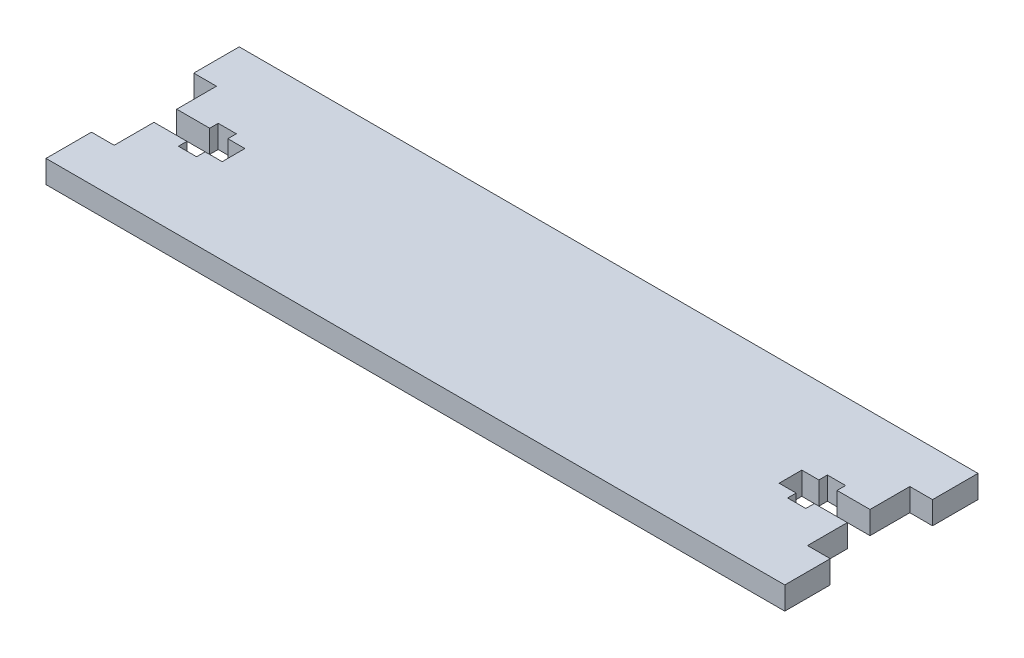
ISO-10303-21;
HEADER;
FILE_DESCRIPTION(('STEP AP214'),'2;1');
FILE_NAME('part.step','',(''),(''),'','','');
FILE_SCHEMA(('AUTOMOTIVE_DESIGN { 1 0 10303 214 1 1 1 1 }'));
ENDSEC;
DATA;
#1=APPLICATION_CONTEXT('core data for automotive mechanical design processes');
#2=APPLICATION_PROTOCOL_DEFINITION('international standard','automotive_design',2000,#1);
#3=PRODUCT_CONTEXT('',#1,'mechanical');
#4=PRODUCT('Part','Part','',(#3));
#5=PRODUCT_RELATED_PRODUCT_CATEGORY('part','',(#4));
#6=PRODUCT_DEFINITION_FORMATION('','',#4);
#7=PRODUCT_DEFINITION_CONTEXT('part definition',#1,'design');
#8=PRODUCT_DEFINITION('design','',#6,#7);
#9=PRODUCT_DEFINITION_SHAPE('','',#8);
#10=(LENGTH_UNIT() NAMED_UNIT(*) SI_UNIT(.MILLI.,.METRE.));
#11=(NAMED_UNIT(*) PLANE_ANGLE_UNIT() SI_UNIT($,.RADIAN.));
#12=(NAMED_UNIT(*) SI_UNIT($,.STERADIAN.) SOLID_ANGLE_UNIT());
#13=UNCERTAINTY_MEASURE_WITH_UNIT(LENGTH_MEASURE(1.E-05),#10,'distance_accuracy_value','');
#14=(GEOMETRIC_REPRESENTATION_CONTEXT(3) GLOBAL_UNCERTAINTY_ASSIGNED_CONTEXT((#13)) GLOBAL_UNIT_ASSIGNED_CONTEXT((#10,
#11,#12)) REPRESENTATION_CONTEXT('',''));
#15=CARTESIAN_POINT('',(0.,0.,0.));
#16=DIRECTION('',(0.,0.,1.));
#17=DIRECTION('',(1.,0.,0.));
#18=AXIS2_PLACEMENT_3D('',#15,#16,#17);
#19=CARTESIAN_POINT('',(-65.,4.,17.));
#20=DIRECTION('',(1.,0.,0.));
#21=DIRECTION('',(0.,0.,-1.));
#22=AXIS2_PLACEMENT_3D('',#19,#20,#21);
#23=PLANE('',#22);
#24=DIRECTION('',(0.,0.,1.));
#25=VECTOR('',#24,1.);
#26=CARTESIAN_POINT('',(-65.,0.,17.));
#27=LINE('',#26,#25);
#28=CARTESIAN_POINT('',(-65.,0.,9.));
#29=VERTEX_POINT('',#28);
#30=CARTESIAN_POINT('',(-65.,0.,17.));
#31=VERTEX_POINT('',#30);
#32=EDGE_CURVE('E297',#29,#31,#27,.T.);
#33=ORIENTED_EDGE('',*,*,#32,.T.);
#34=DIRECTION('',(0.,-1.,0.));
#35=VECTOR('',#34,1.);
#36=CARTESIAN_POINT('',(-65.,4.,17.));
#37=LINE('',#36,#35);
#38=CARTESIAN_POINT('',(-65.,4.,17.));
#39=VERTEX_POINT('',#38);
#40=EDGE_CURVE('E11',#39,#31,#37,.T.);
#41=ORIENTED_EDGE('',*,*,#40,.F.);
#42=DIRECTION('',(0.,0.,1.));
#43=VECTOR('',#42,1.);
#44=CARTESIAN_POINT('',(-65.,4.,17.));
#45=LINE('',#44,#43);
#46=CARTESIAN_POINT('',(-65.,4.,9.));
#47=VERTEX_POINT('',#46);
#48=EDGE_CURVE('E367',#47,#39,#45,.T.);
#49=ORIENTED_EDGE('',*,*,#48,.F.);
#50=DIRECTION('',(0.,-1.,0.));
#51=VECTOR('',#50,1.);
#52=CARTESIAN_POINT('',(-65.,4.,9.));
#53=LINE('',#52,#51);
#54=EDGE_CURVE('E293',#47,#29,#53,.T.);
#55=ORIENTED_EDGE('',*,*,#54,.T.);
#56=EDGE_LOOP('',(#33,#41,#49,#55));
#57=FACE_BOUND('',#56,.T.);
#58=ADVANCED_FACE('F33',(#57),#23,.F.);
#59=CARTESIAN_POINT('',(65.,4.,17.));
#60=DIRECTION('',(0.,0.,-1.));
#61=DIRECTION('',(-1.,0.,0.));
#62=AXIS2_PLACEMENT_3D('',#59,#60,#61);
#63=PLANE('',#62);
#64=DIRECTION('',(1.,0.,0.));
#65=VECTOR('',#64,1.);
#66=CARTESIAN_POINT('',(65.,0.,17.));
#67=LINE('',#66,#65);
#68=CARTESIAN_POINT('',(65.,0.,17.));
#69=VERTEX_POINT('',#68);
#70=EDGE_CURVE('E300',#31,#69,#67,.T.);
#71=ORIENTED_EDGE('',*,*,#70,.T.);
#72=DIRECTION('',(0.,-1.,0.));
#73=VECTOR('',#72,1.);
#74=CARTESIAN_POINT('',(65.,4.,17.));
#75=LINE('',#74,#73);
#76=CARTESIAN_POINT('',(65.,4.,17.));
#77=VERTEX_POINT('',#76);
#78=EDGE_CURVE('E41',#77,#69,#75,.T.);
#79=ORIENTED_EDGE('',*,*,#78,.F.);
#80=DIRECTION('',(1.,0.,0.));
#81=VECTOR('',#80,1.);
#82=CARTESIAN_POINT('',(65.,4.,17.));
#83=LINE('',#82,#81);
#84=EDGE_CURVE('E176',#39,#77,#83,.T.);
#85=ORIENTED_EDGE('',*,*,#84,.F.);
#86=ORIENTED_EDGE('',*,*,#40,.T.);
#87=EDGE_LOOP('',(#71,#79,#85,#86));
#88=FACE_BOUND('',#87,.T.);
#89=ADVANCED_FACE('F565',(#88),#63,.F.);
#90=CARTESIAN_POINT('',(65.,4.,17.));
#91=DIRECTION('',(-1.,0.,0.));
#92=DIRECTION('',(0.,0.,1.));
#93=AXIS2_PLACEMENT_3D('',#90,#91,#92);
#94=PLANE('',#93);
#95=DIRECTION('',(0.,0.,-1.));
#96=VECTOR('',#95,1.);
#97=CARTESIAN_POINT('',(65.,0.,17.));
#98=LINE('',#97,#96);
#99=CARTESIAN_POINT('',(65.,0.,8.99999999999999));
#100=VERTEX_POINT('',#99);
#101=EDGE_CURVE('E302',#69,#100,#98,.T.);
#102=ORIENTED_EDGE('',*,*,#101,.T.);
#103=DIRECTION('',(0.,-1.,0.));
#104=VECTOR('',#103,1.);
#105=CARTESIAN_POINT('',(65.,4.,8.99999999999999));
#106=LINE('',#105,#104);
#107=CARTESIAN_POINT('',(65.,4.,8.99999999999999));
#108=VERTEX_POINT('',#107);
#109=EDGE_CURVE('E458',#108,#100,#106,.T.);
#110=ORIENTED_EDGE('',*,*,#109,.F.);
#111=DIRECTION('',(0.,0.,-1.));
#112=VECTOR('',#111,1.);
#113=CARTESIAN_POINT('',(65.,4.,17.));
#114=LINE('',#113,#112);
#115=EDGE_CURVE('E466',#77,#108,#114,.T.);
#116=ORIENTED_EDGE('',*,*,#115,.F.);
#117=ORIENTED_EDGE('',*,*,#78,.T.);
#118=EDGE_LOOP('',(#102,#110,#116,#117));
#119=FACE_BOUND('',#118,.T.);
#120=ADVANCED_FACE('F464',(#119),#94,.F.);
#121=CARTESIAN_POINT('',(65.,4.,8.99999999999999));
#122=DIRECTION('',(0.,0.,1.));
#123=DIRECTION('',(1.,0.,0.));
#124=AXIS2_PLACEMENT_3D('',#121,#122,#123);
#125=PLANE('',#124);
#126=DIRECTION('',(-1.,0.,0.));
#127=VECTOR('',#126,1.);
#128=CARTESIAN_POINT('',(65.,0.,8.99999999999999));
#129=LINE('',#128,#127);
#130=CARTESIAN_POINT('',(61.,0.,9.00000000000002));
#131=VERTEX_POINT('',#130);
#132=EDGE_CURVE('E304',#100,#131,#129,.T.);
#133=ORIENTED_EDGE('',*,*,#132,.T.);
#134=DIRECTION('',(0.,-1.,0.));
#135=VECTOR('',#134,1.);
#136=CARTESIAN_POINT('',(61.,4.,9.00000000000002));
#137=LINE('',#136,#135);
#138=CARTESIAN_POINT('',(61.,4.,9.00000000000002));
#139=VERTEX_POINT('',#138);
#140=EDGE_CURVE('E455',#139,#131,#137,.T.);
#141=ORIENTED_EDGE('',*,*,#140,.F.);
#142=DIRECTION('',(-1.,0.,0.));
#143=VECTOR('',#142,1.);
#144=CARTESIAN_POINT('',(65.,4.,8.99999999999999));
#145=LINE('',#144,#143);
#146=EDGE_CURVE('E484',#108,#139,#145,.T.);
#147=ORIENTED_EDGE('',*,*,#146,.F.);
#148=ORIENTED_EDGE('',*,*,#109,.T.);
#149=EDGE_LOOP('',(#133,#141,#147,#148));
#150=FACE_BOUND('',#149,.T.);
#151=ADVANCED_FACE('F475',(#150),#125,.F.);
#152=CARTESIAN_POINT('',(61.,4.,2.00000000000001));
#153=DIRECTION('',(-1.,0.,0.));
#154=DIRECTION('',(0.,0.,1.));
#155=AXIS2_PLACEMENT_3D('',#152,#153,#154);
#156=PLANE('',#155);
#157=DIRECTION('',(0.,0.,-1.));
#158=VECTOR('',#157,1.);
#159=CARTESIAN_POINT('',(61.,0.,2.00000000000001));
#160=LINE('',#159,#158);
#161=CARTESIAN_POINT('',(61.,0.,2.00000000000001));
#162=VERTEX_POINT('',#161);
#163=EDGE_CURVE('E306',#131,#162,#160,.T.);
#164=ORIENTED_EDGE('',*,*,#163,.T.);
#165=DIRECTION('',(0.,-1.,0.));
#166=VECTOR('',#165,1.);
#167=CARTESIAN_POINT('',(61.,4.,2.00000000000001));
#168=LINE('',#167,#166);
#169=CARTESIAN_POINT('',(61.,4.,2.00000000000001));
#170=VERTEX_POINT('',#169);
#171=EDGE_CURVE('E452',#170,#162,#168,.T.);
#172=ORIENTED_EDGE('',*,*,#171,.F.);
#173=DIRECTION('',(0.,0.,-1.));
#174=VECTOR('',#173,1.);
#175=CARTESIAN_POINT('',(61.,4.,2.00000000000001));
#176=LINE('',#175,#174);
#177=EDGE_CURVE('E481',#139,#170,#176,.T.);
#178=ORIENTED_EDGE('',*,*,#177,.F.);
#179=ORIENTED_EDGE('',*,*,#140,.T.);
#180=EDGE_LOOP('',(#164,#172,#178,#179));
#181=FACE_BOUND('',#180,.T.);
#182=ADVANCED_FACE('F479',(#181),#156,.F.);
#183=CARTESIAN_POINT('',(61.,4.,2.00000000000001));
#184=DIRECTION('',(0.,0.,1.));
#185=DIRECTION('',(1.,0.,0.));
#186=AXIS2_PLACEMENT_3D('',#183,#184,#185);
#187=PLANE('',#186);
#188=DIRECTION('',(-1.,0.,0.));
#189=VECTOR('',#188,1.);
#190=CARTESIAN_POINT('',(61.,0.,2.00000000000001));
#191=LINE('',#190,#189);
#192=CARTESIAN_POINT('',(55.2,0.,2.00000000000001));
#193=VERTEX_POINT('',#192);
#194=EDGE_CURVE('E308',#162,#193,#191,.T.);
#195=ORIENTED_EDGE('',*,*,#194,.T.);
#196=DIRECTION('',(0.,-1.,0.));
#197=VECTOR('',#196,1.);
#198=CARTESIAN_POINT('',(55.2,4.,2.00000000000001));
#199=LINE('',#198,#197);
#200=CARTESIAN_POINT('',(55.2,4.,2.00000000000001));
#201=VERTEX_POINT('',#200);
#202=EDGE_CURVE('E449',#201,#193,#199,.T.);
#203=ORIENTED_EDGE('',*,*,#202,.F.);
#204=DIRECTION('',(-1.,0.,0.));
#205=VECTOR('',#204,1.);
#206=CARTESIAN_POINT('',(61.,4.,2.00000000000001));
#207=LINE('',#206,#205);
#208=EDGE_CURVE('E483',#170,#201,#207,.T.);
#209=ORIENTED_EDGE('',*,*,#208,.F.);
#210=ORIENTED_EDGE('',*,*,#171,.T.);
#211=EDGE_LOOP('',(#195,#203,#209,#210));
#212=FACE_BOUND('',#211,.T.);
#213=ADVANCED_FACE('F578',(#212),#187,.F.);
#214=CARTESIAN_POINT('',(55.2,4.,2.00000000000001));
#215=DIRECTION('',(1.,0.,0.));
#216=DIRECTION('',(0.,0.,-1.));
#217=AXIS2_PLACEMENT_3D('',#214,#215,#216);
#218=PLANE('',#217);
#219=DIRECTION('',(0.,0.,1.));
#220=VECTOR('',#219,1.);
#221=CARTESIAN_POINT('',(55.2,0.,2.00000000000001));
#222=LINE('',#221,#220);
#223=CARTESIAN_POINT('',(55.2,0.,3.49999999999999));
#224=VERTEX_POINT('',#223);
#225=EDGE_CURVE('E310',#193,#224,#222,.T.);
#226=ORIENTED_EDGE('',*,*,#225,.T.);
#227=DIRECTION('',(0.,-1.,0.));
#228=VECTOR('',#227,1.);
#229=CARTESIAN_POINT('',(55.2,4.,3.49999999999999));
#230=LINE('',#229,#228);
#231=CARTESIAN_POINT('',(55.2,4.,3.49999999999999));
#232=VERTEX_POINT('',#231);
#233=EDGE_CURVE('E446',#232,#224,#230,.T.);
#234=ORIENTED_EDGE('',*,*,#233,.F.);
#235=DIRECTION('',(0.,0.,1.));
#236=VECTOR('',#235,1.);
#237=CARTESIAN_POINT('',(55.2,4.,2.00000000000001));
#238=LINE('',#237,#236);
#239=EDGE_CURVE('E486',#201,#232,#238,.T.);
#240=ORIENTED_EDGE('',*,*,#239,.F.);
#241=ORIENTED_EDGE('',*,*,#202,.T.);
#242=EDGE_LOOP('',(#226,#234,#240,#241));
#243=FACE_BOUND('',#242,.T.);
#244=ADVANCED_FACE('F581',(#243),#218,.F.);
#245=CARTESIAN_POINT('',(55.2,4.,3.49999999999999));
#246=DIRECTION('',(0.,0.,1.));
#247=DIRECTION('',(1.,0.,0.));
#248=AXIS2_PLACEMENT_3D('',#245,#246,#247);
#249=PLANE('',#248);
#250=DIRECTION('',(-1.,0.,0.));
#251=VECTOR('',#250,1.);
#252=CARTESIAN_POINT('',(55.2,0.,3.49999999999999));
#253=LINE('',#252,#251);
#254=CARTESIAN_POINT('',(52.,0.,3.49999999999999));
#255=VERTEX_POINT('',#254);
#256=EDGE_CURVE('E312',#224,#255,#253,.T.);
#257=ORIENTED_EDGE('',*,*,#256,.T.);
#258=DIRECTION('',(0.,-1.,0.));
#259=VECTOR('',#258,1.);
#260=CARTESIAN_POINT('',(52.,4.,3.49999999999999));
#261=LINE('',#260,#259);
#262=CARTESIAN_POINT('',(52.,4.,3.49999999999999));
#263=VERTEX_POINT('',#262);
#264=EDGE_CURVE('E443',#263,#255,#261,.T.);
#265=ORIENTED_EDGE('',*,*,#264,.F.);
#266=DIRECTION('',(-1.,0.,0.));
#267=VECTOR('',#266,1.);
#268=CARTESIAN_POINT('',(55.2,4.,3.49999999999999));
#269=LINE('',#268,#267);
#270=EDGE_CURVE('E492',#232,#263,#269,.T.);
#271=ORIENTED_EDGE('',*,*,#270,.F.);
#272=ORIENTED_EDGE('',*,*,#233,.T.);
#273=EDGE_LOOP('',(#257,#265,#271,#272));
#274=FACE_BOUND('',#273,.T.);
#275=ADVANCED_FACE('F585',(#274),#249,.F.);
#276=CARTESIAN_POINT('',(52.,4.,1.99999999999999));
#277=DIRECTION('',(-1.,0.,0.));
#278=DIRECTION('',(0.,0.,1.));
#279=AXIS2_PLACEMENT_3D('',#276,#277,#278);
#280=PLANE('',#279);
#281=DIRECTION('',(0.,0.,-1.));
#282=VECTOR('',#281,1.);
#283=CARTESIAN_POINT('',(52.,0.,1.99999999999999));
#284=LINE('',#283,#282);
#285=CARTESIAN_POINT('',(52.,0.,1.99999999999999));
#286=VERTEX_POINT('',#285);
#287=EDGE_CURVE('E314',#255,#286,#284,.T.);
#288=ORIENTED_EDGE('',*,*,#287,.T.);
#289=DIRECTION('',(0.,-1.,0.));
#290=VECTOR('',#289,1.);
#291=CARTESIAN_POINT('',(52.,4.,1.99999999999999));
#292=LINE('',#291,#290);
#293=CARTESIAN_POINT('',(52.,4.,1.99999999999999));
#294=VERTEX_POINT('',#293);
#295=EDGE_CURVE('E440',#294,#286,#292,.T.);
#296=ORIENTED_EDGE('',*,*,#295,.F.);
#297=DIRECTION('',(0.,0.,-1.));
#298=VECTOR('',#297,1.);
#299=CARTESIAN_POINT('',(52.,4.,1.99999999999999));
#300=LINE('',#299,#298);
#301=EDGE_CURVE('E494',#263,#294,#300,.T.);
#302=ORIENTED_EDGE('',*,*,#301,.F.);
#303=ORIENTED_EDGE('',*,*,#264,.T.);
#304=EDGE_LOOP('',(#288,#296,#302,#303));
#305=FACE_BOUND('',#304,.T.);
#306=ADVANCED_FACE('F589',(#305),#280,.F.);
#307=CARTESIAN_POINT('',(52.,4.,1.99999999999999));
#308=DIRECTION('',(0.,0.,1.));
#309=DIRECTION('',(1.,0.,0.));
#310=AXIS2_PLACEMENT_3D('',#307,#308,#309);
#311=PLANE('',#310);
#312=DIRECTION('',(-1.,0.,0.));
#313=VECTOR('',#312,1.);
#314=CARTESIAN_POINT('',(52.,0.,1.99999999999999));
#315=LINE('',#314,#313);
#316=CARTESIAN_POINT('',(49.,0.,2.00000000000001));
#317=VERTEX_POINT('',#316);
#318=EDGE_CURVE('E316',#286,#317,#315,.T.);
#319=ORIENTED_EDGE('',*,*,#318,.T.);
#320=DIRECTION('',(0.,-1.,0.));
#321=VECTOR('',#320,1.);
#322=CARTESIAN_POINT('',(49.,4.,2.00000000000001));
#323=LINE('',#322,#321);
#324=CARTESIAN_POINT('',(49.,4.,2.00000000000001));
#325=VERTEX_POINT('',#324);
#326=EDGE_CURVE('E437',#325,#317,#323,.T.);
#327=ORIENTED_EDGE('',*,*,#326,.F.);
#328=DIRECTION('',(-1.,0.,0.));
#329=VECTOR('',#328,1.);
#330=CARTESIAN_POINT('',(52.,4.,1.99999999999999));
#331=LINE('',#330,#329);
#332=EDGE_CURVE('E496',#294,#325,#331,.T.);
#333=ORIENTED_EDGE('',*,*,#332,.F.);
#334=ORIENTED_EDGE('',*,*,#295,.T.);
#335=EDGE_LOOP('',(#319,#327,#333,#334));
#336=FACE_BOUND('',#335,.T.);
#337=ADVANCED_FACE('F593',(#336),#311,.F.);
#338=CARTESIAN_POINT('',(49.,4.,-2.00000000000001));
#339=DIRECTION('',(-1.,0.,0.));
#340=DIRECTION('',(0.,0.,1.));
#341=AXIS2_PLACEMENT_3D('',#338,#339,#340);
#342=PLANE('',#341);
#343=DIRECTION('',(0.,0.,-1.));
#344=VECTOR('',#343,1.);
#345=CARTESIAN_POINT('',(49.,0.,-2.00000000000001));
#346=LINE('',#345,#344);
#347=CARTESIAN_POINT('',(49.,0.,-2.00000000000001));
#348=VERTEX_POINT('',#347);
#349=EDGE_CURVE('E318',#317,#348,#346,.T.);
#350=ORIENTED_EDGE('',*,*,#349,.T.);
#351=DIRECTION('',(0.,-1.,0.));
#352=VECTOR('',#351,1.);
#353=CARTESIAN_POINT('',(49.,4.,-2.00000000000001));
#354=LINE('',#353,#352);
#355=CARTESIAN_POINT('',(49.,4.,-2.00000000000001));
#356=VERTEX_POINT('',#355);
#357=EDGE_CURVE('E434',#356,#348,#354,.T.);
#358=ORIENTED_EDGE('',*,*,#357,.F.);
#359=DIRECTION('',(0.,0.,-1.));
#360=VECTOR('',#359,1.);
#361=CARTESIAN_POINT('',(49.,4.,-2.00000000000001));
#362=LINE('',#361,#360);
#363=EDGE_CURVE('E498',#325,#356,#362,.T.);
#364=ORIENTED_EDGE('',*,*,#363,.F.);
#365=ORIENTED_EDGE('',*,*,#326,.T.);
#366=EDGE_LOOP('',(#350,#358,#364,#365));
#367=FACE_BOUND('',#366,.T.);
#368=ADVANCED_FACE('F597',(#367),#342,.F.);
#369=CARTESIAN_POINT('',(52.,4.,-1.99999999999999));
#370=DIRECTION('',(0.,0.,-1.));
#371=DIRECTION('',(-1.,0.,0.));
#372=AXIS2_PLACEMENT_3D('',#369,#370,#371);
#373=PLANE('',#372);
#374=DIRECTION('',(1.,0.,0.));
#375=VECTOR('',#374,1.);
#376=CARTESIAN_POINT('',(52.,0.,-1.99999999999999));
#377=LINE('',#376,#375);
#378=CARTESIAN_POINT('',(52.,0.,-1.99999999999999));
#379=VERTEX_POINT('',#378);
#380=EDGE_CURVE('E320',#348,#379,#377,.T.);
#381=ORIENTED_EDGE('',*,*,#380,.T.);
#382=DIRECTION('',(0.,-1.,0.));
#383=VECTOR('',#382,1.);
#384=CARTESIAN_POINT('',(52.,4.,-1.99999999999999));
#385=LINE('',#384,#383);
#386=CARTESIAN_POINT('',(52.,4.,-1.99999999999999));
#387=VERTEX_POINT('',#386);
#388=EDGE_CURVE('E431',#387,#379,#385,.T.);
#389=ORIENTED_EDGE('',*,*,#388,.F.);
#390=DIRECTION('',(1.,0.,0.));
#391=VECTOR('',#390,1.);
#392=CARTESIAN_POINT('',(52.,4.,-1.99999999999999));
#393=LINE('',#392,#391);
#394=EDGE_CURVE('E500',#356,#387,#393,.T.);
#395=ORIENTED_EDGE('',*,*,#394,.F.);
#396=ORIENTED_EDGE('',*,*,#357,.T.);
#397=EDGE_LOOP('',(#381,#389,#395,#396));
#398=FACE_BOUND('',#397,.T.);
#399=ADVANCED_FACE('F601',(#398),#373,.F.);
#400=CARTESIAN_POINT('',(52.,4.,-3.49999999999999));
#401=DIRECTION('',(-1.,0.,0.));
#402=DIRECTION('',(0.,0.,1.));
#403=AXIS2_PLACEMENT_3D('',#400,#401,#402);
#404=PLANE('',#403);
#405=DIRECTION('',(0.,0.,-1.));
#406=VECTOR('',#405,1.);
#407=CARTESIAN_POINT('',(52.,0.,-3.49999999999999));
#408=LINE('',#407,#406);
#409=CARTESIAN_POINT('',(52.,0.,-3.49999999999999));
#410=VERTEX_POINT('',#409);
#411=EDGE_CURVE('E322',#379,#410,#408,.T.);
#412=ORIENTED_EDGE('',*,*,#411,.T.);
#413=DIRECTION('',(0.,-1.,0.));
#414=VECTOR('',#413,1.);
#415=CARTESIAN_POINT('',(52.,4.,-3.49999999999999));
#416=LINE('',#415,#414);
#417=CARTESIAN_POINT('',(52.,4.,-3.49999999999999));
#418=VERTEX_POINT('',#417);
#419=EDGE_CURVE('E428',#418,#410,#416,.T.);
#420=ORIENTED_EDGE('',*,*,#419,.F.);
#421=DIRECTION('',(0.,0.,-1.));
#422=VECTOR('',#421,1.);
#423=CARTESIAN_POINT('',(52.,4.,-3.49999999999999));
#424=LINE('',#423,#422);
#425=EDGE_CURVE('E502',#387,#418,#424,.T.);
#426=ORIENTED_EDGE('',*,*,#425,.F.);
#427=ORIENTED_EDGE('',*,*,#388,.T.);
#428=EDGE_LOOP('',(#412,#420,#426,#427));
#429=FACE_BOUND('',#428,.T.);
#430=ADVANCED_FACE('F605',(#429),#404,.F.);
#431=CARTESIAN_POINT('',(55.2,4.,-3.49999999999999));
#432=DIRECTION('',(0.,0.,-1.));
#433=DIRECTION('',(-1.,0.,0.));
#434=AXIS2_PLACEMENT_3D('',#431,#432,#433);
#435=PLANE('',#434);
#436=DIRECTION('',(1.,0.,0.));
#437=VECTOR('',#436,1.);
#438=CARTESIAN_POINT('',(55.2,0.,-3.49999999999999));
#439=LINE('',#438,#437);
#440=CARTESIAN_POINT('',(55.2,0.,-3.49999999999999));
#441=VERTEX_POINT('',#440);
#442=EDGE_CURVE('E324',#410,#441,#439,.T.);
#443=ORIENTED_EDGE('',*,*,#442,.T.);
#444=DIRECTION('',(0.,-1.,0.));
#445=VECTOR('',#444,1.);
#446=CARTESIAN_POINT('',(55.2,4.,-3.49999999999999));
#447=LINE('',#446,#445);
#448=CARTESIAN_POINT('',(55.2,4.,-3.49999999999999));
#449=VERTEX_POINT('',#448);
#450=EDGE_CURVE('E425',#449,#441,#447,.T.);
#451=ORIENTED_EDGE('',*,*,#450,.F.);
#452=DIRECTION('',(1.,0.,0.));
#453=VECTOR('',#452,1.);
#454=CARTESIAN_POINT('',(55.2,4.,-3.49999999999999));
#455=LINE('',#454,#453);
#456=EDGE_CURVE('E504',#418,#449,#455,.T.);
#457=ORIENTED_EDGE('',*,*,#456,.F.);
#458=ORIENTED_EDGE('',*,*,#419,.T.);
#459=EDGE_LOOP('',(#443,#451,#457,#458));
#460=FACE_BOUND('',#459,.T.);
#461=ADVANCED_FACE('F609',(#460),#435,.F.);
#462=CARTESIAN_POINT('',(55.2,4.,-3.49999999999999));
#463=DIRECTION('',(1.,0.,0.));
#464=DIRECTION('',(0.,0.,-1.));
#465=AXIS2_PLACEMENT_3D('',#462,#463,#464);
#466=PLANE('',#465);
#467=DIRECTION('',(0.,0.,1.));
#468=VECTOR('',#467,1.);
#469=CARTESIAN_POINT('',(55.2,0.,-3.49999999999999));
#470=LINE('',#469,#468);
#471=CARTESIAN_POINT('',(55.2,0.,-2.00000000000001));
#472=VERTEX_POINT('',#471);
#473=EDGE_CURVE('E326',#441,#472,#470,.T.);
#474=ORIENTED_EDGE('',*,*,#473,.T.);
#475=DIRECTION('',(0.,-1.,0.));
#476=VECTOR('',#475,1.);
#477=CARTESIAN_POINT('',(55.2,4.,-2.00000000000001));
#478=LINE('',#477,#476);
#479=CARTESIAN_POINT('',(55.2,4.,-2.00000000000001));
#480=VERTEX_POINT('',#479);
#481=EDGE_CURVE('E422',#480,#472,#478,.T.);
#482=ORIENTED_EDGE('',*,*,#481,.F.);
#483=DIRECTION('',(0.,0.,1.));
#484=VECTOR('',#483,1.);
#485=CARTESIAN_POINT('',(55.2,4.,-3.49999999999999));
#486=LINE('',#485,#484);
#487=EDGE_CURVE('E506',#449,#480,#486,.T.);
#488=ORIENTED_EDGE('',*,*,#487,.F.);
#489=ORIENTED_EDGE('',*,*,#450,.T.);
#490=EDGE_LOOP('',(#474,#482,#488,#489));
#491=FACE_BOUND('',#490,.T.);
#492=ADVANCED_FACE('F613',(#491),#466,.F.);
#493=CARTESIAN_POINT('',(61.,4.,-2.00000000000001));
#494=DIRECTION('',(0.,0.,-1.));
#495=DIRECTION('',(-1.,0.,0.));
#496=AXIS2_PLACEMENT_3D('',#493,#494,#495);
#497=PLANE('',#496);
#498=DIRECTION('',(1.,0.,0.));
#499=VECTOR('',#498,1.);
#500=CARTESIAN_POINT('',(61.,0.,-2.00000000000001));
#501=LINE('',#500,#499);
#502=CARTESIAN_POINT('',(61.,0.,-2.00000000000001));
#503=VERTEX_POINT('',#502);
#504=EDGE_CURVE('E328',#472,#503,#501,.T.);
#505=ORIENTED_EDGE('',*,*,#504,.T.);
#506=DIRECTION('',(0.,-1.,0.));
#507=VECTOR('',#506,1.);
#508=CARTESIAN_POINT('',(61.,4.,-2.00000000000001));
#509=LINE('',#508,#507);
#510=CARTESIAN_POINT('',(61.,4.,-2.00000000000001));
#511=VERTEX_POINT('',#510);
#512=EDGE_CURVE('E419',#511,#503,#509,.T.);
#513=ORIENTED_EDGE('',*,*,#512,.F.);
#514=DIRECTION('',(1.,0.,0.));
#515=VECTOR('',#514,1.);
#516=CARTESIAN_POINT('',(61.,4.,-2.00000000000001));
#517=LINE('',#516,#515);
#518=EDGE_CURVE('E508',#480,#511,#517,.T.);
#519=ORIENTED_EDGE('',*,*,#518,.F.);
#520=ORIENTED_EDGE('',*,*,#481,.T.);
#521=EDGE_LOOP('',(#505,#513,#519,#520));
#522=FACE_BOUND('',#521,.T.);
#523=ADVANCED_FACE('F617',(#522),#497,.F.);
#524=CARTESIAN_POINT('',(61.,4.,-9.00000000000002));
#525=DIRECTION('',(-1.,0.,0.));
#526=DIRECTION('',(0.,0.,1.));
#527=AXIS2_PLACEMENT_3D('',#524,#525,#526);
#528=PLANE('',#527);
#529=DIRECTION('',(0.,0.,-1.));
#530=VECTOR('',#529,1.);
#531=CARTESIAN_POINT('',(61.,0.,-9.00000000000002));
#532=LINE('',#531,#530);
#533=CARTESIAN_POINT('',(61.,0.,-9.00000000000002));
#534=VERTEX_POINT('',#533);
#535=EDGE_CURVE('E330',#503,#534,#532,.T.);
#536=ORIENTED_EDGE('',*,*,#535,.T.);
#537=DIRECTION('',(0.,-1.,0.));
#538=VECTOR('',#537,1.);
#539=CARTESIAN_POINT('',(61.,4.,-9.00000000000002));
#540=LINE('',#539,#538);
#541=CARTESIAN_POINT('',(61.,4.,-9.00000000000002));
#542=VERTEX_POINT('',#541);
#543=EDGE_CURVE('E416',#542,#534,#540,.T.);
#544=ORIENTED_EDGE('',*,*,#543,.F.);
#545=DIRECTION('',(0.,0.,-1.));
#546=VECTOR('',#545,1.);
#547=CARTESIAN_POINT('',(61.,4.,-9.00000000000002));
#548=LINE('',#547,#546);
#549=EDGE_CURVE('E510',#511,#542,#548,.T.);
#550=ORIENTED_EDGE('',*,*,#549,.F.);
#551=ORIENTED_EDGE('',*,*,#512,.T.);
#552=EDGE_LOOP('',(#536,#544,#550,#551));
#553=FACE_BOUND('',#552,.T.);
#554=ADVANCED_FACE('F621',(#553),#528,.F.);
#555=CARTESIAN_POINT('',(65.,4.,-8.99999999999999));
#556=DIRECTION('',(0.,0.,-1.));
#557=DIRECTION('',(-1.,0.,0.));
#558=AXIS2_PLACEMENT_3D('',#555,#556,#557);
#559=PLANE('',#558);
#560=DIRECTION('',(1.,0.,0.));
#561=VECTOR('',#560,1.);
#562=CARTESIAN_POINT('',(65.,0.,-8.99999999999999));
#563=LINE('',#562,#561);
#564=CARTESIAN_POINT('',(65.,0.,-8.99999999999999));
#565=VERTEX_POINT('',#564);
#566=EDGE_CURVE('E332',#534,#565,#563,.T.);
#567=ORIENTED_EDGE('',*,*,#566,.T.);
#568=DIRECTION('',(0.,-1.,0.));
#569=VECTOR('',#568,1.);
#570=CARTESIAN_POINT('',(65.,4.,-8.99999999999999));
#571=LINE('',#570,#569);
#572=CARTESIAN_POINT('',(65.,4.,-8.99999999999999));
#573=VERTEX_POINT('',#572);
#574=EDGE_CURVE('E413',#573,#565,#571,.T.);
#575=ORIENTED_EDGE('',*,*,#574,.F.);
#576=DIRECTION('',(1.,0.,0.));
#577=VECTOR('',#576,1.);
#578=CARTESIAN_POINT('',(65.,4.,-8.99999999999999));
#579=LINE('',#578,#577);
#580=EDGE_CURVE('E512',#542,#573,#579,.T.);
#581=ORIENTED_EDGE('',*,*,#580,.F.);
#582=ORIENTED_EDGE('',*,*,#543,.T.);
#583=EDGE_LOOP('',(#567,#575,#581,#582));
#584=FACE_BOUND('',#583,.T.);
#585=ADVANCED_FACE('F625',(#584),#559,.F.);
#586=CARTESIAN_POINT('',(65.,4.,-17.));
#587=DIRECTION('',(-1.,0.,0.));
#588=DIRECTION('',(0.,0.,1.));
#589=AXIS2_PLACEMENT_3D('',#586,#587,#588);
#590=PLANE('',#589);
#591=DIRECTION('',(0.,0.,-1.));
#592=VECTOR('',#591,1.);
#593=CARTESIAN_POINT('',(65.,0.,-17.));
#594=LINE('',#593,#592);
#595=CARTESIAN_POINT('',(65.,0.,-17.));
#596=VERTEX_POINT('',#595);
#597=EDGE_CURVE('E334',#565,#596,#594,.T.);
#598=ORIENTED_EDGE('',*,*,#597,.T.);
#599=DIRECTION('',(0.,-1.,0.));
#600=VECTOR('',#599,1.);
#601=CARTESIAN_POINT('',(65.,4.,-17.));
#602=LINE('',#601,#600);
#603=CARTESIAN_POINT('',(65.,4.,-17.));
#604=VERTEX_POINT('',#603);
#605=EDGE_CURVE('E410',#604,#596,#602,.T.);
#606=ORIENTED_EDGE('',*,*,#605,.F.);
#607=DIRECTION('',(0.,0.,-1.));
#608=VECTOR('',#607,1.);
#609=CARTESIAN_POINT('',(65.,4.,-17.));
#610=LINE('',#609,#608);
#611=EDGE_CURVE('E514',#573,#604,#610,.T.);
#612=ORIENTED_EDGE('',*,*,#611,.F.);
#613=ORIENTED_EDGE('',*,*,#574,.T.);
#614=EDGE_LOOP('',(#598,#606,#612,#613));
#615=FACE_BOUND('',#614,.T.);
#616=ADVANCED_FACE('F629',(#615),#590,.F.);
#617=CARTESIAN_POINT('',(-65.,4.,-17.));
#618=DIRECTION('',(0.,0.,1.));
#619=DIRECTION('',(1.,0.,0.));
#620=AXIS2_PLACEMENT_3D('',#617,#618,#619);
#621=PLANE('',#620);
#622=DIRECTION('',(-1.,0.,0.));
#623=VECTOR('',#622,1.);
#624=CARTESIAN_POINT('',(-65.,0.,-17.));
#625=LINE('',#624,#623);
#626=CARTESIAN_POINT('',(-65.,0.,-17.));
#627=VERTEX_POINT('',#626);
#628=EDGE_CURVE('E336',#596,#627,#625,.T.);
#629=ORIENTED_EDGE('',*,*,#628,.T.);
#630=DIRECTION('',(0.,-1.,0.));
#631=VECTOR('',#630,1.);
#632=CARTESIAN_POINT('',(-65.,4.,-17.));
#633=LINE('',#632,#631);
#634=CARTESIAN_POINT('',(-65.,4.,-17.));
#635=VERTEX_POINT('',#634);
#636=EDGE_CURVE('E407',#635,#627,#633,.T.);
#637=ORIENTED_EDGE('',*,*,#636,.F.);
#638=DIRECTION('',(-1.,0.,0.));
#639=VECTOR('',#638,1.);
#640=CARTESIAN_POINT('',(-65.,4.,-17.));
#641=LINE('',#640,#639);
#642=EDGE_CURVE('E516',#604,#635,#641,.T.);
#643=ORIENTED_EDGE('',*,*,#642,.F.);
#644=ORIENTED_EDGE('',*,*,#605,.T.);
#645=EDGE_LOOP('',(#629,#637,#643,#644));
#646=FACE_BOUND('',#645,.T.);
#647=ADVANCED_FACE('F633',(#646),#621,.F.);
#648=CARTESIAN_POINT('',(-65.,4.,-17.));
#649=DIRECTION('',(1.,0.,0.));
#650=DIRECTION('',(0.,0.,-1.));
#651=AXIS2_PLACEMENT_3D('',#648,#649,#650);
#652=PLANE('',#651);
#653=DIRECTION('',(0.,0.,1.));
#654=VECTOR('',#653,1.);
#655=CARTESIAN_POINT('',(-65.,0.,-17.));
#656=LINE('',#655,#654);
#657=CARTESIAN_POINT('',(-65.,0.,-9.));
#658=VERTEX_POINT('',#657);
#659=EDGE_CURVE('E338',#627,#658,#656,.T.);
#660=ORIENTED_EDGE('',*,*,#659,.T.);
#661=DIRECTION('',(0.,-1.,0.));
#662=VECTOR('',#661,1.);
#663=CARTESIAN_POINT('',(-65.,4.,-9.));
#664=LINE('',#663,#662);
#665=CARTESIAN_POINT('',(-65.,4.,-9.));
#666=VERTEX_POINT('',#665);
#667=EDGE_CURVE('E404',#666,#658,#664,.T.);
#668=ORIENTED_EDGE('',*,*,#667,.F.);
#669=DIRECTION('',(0.,0.,1.));
#670=VECTOR('',#669,1.);
#671=CARTESIAN_POINT('',(-65.,4.,-17.));
#672=LINE('',#671,#670);
#673=EDGE_CURVE('E518',#635,#666,#672,.T.);
#674=ORIENTED_EDGE('',*,*,#673,.F.);
#675=ORIENTED_EDGE('',*,*,#636,.T.);
#676=EDGE_LOOP('',(#660,#668,#674,#675));
#677=FACE_BOUND('',#676,.T.);
#678=ADVANCED_FACE('F637',(#677),#652,.F.);
#679=CARTESIAN_POINT('',(-65.,4.,-9.));
#680=DIRECTION('',(0.,0.,-1.));
#681=DIRECTION('',(-1.,0.,0.));
#682=AXIS2_PLACEMENT_3D('',#679,#680,#681);
#683=PLANE('',#682);
#684=DIRECTION('',(1.,0.,0.));
#685=VECTOR('',#684,1.);
#686=CARTESIAN_POINT('',(-65.,0.,-9.));
#687=LINE('',#686,#685);
#688=CARTESIAN_POINT('',(-61.,0.,-9.));
#689=VERTEX_POINT('',#688);
#690=EDGE_CURVE('E340',#658,#689,#687,.T.);
#691=ORIENTED_EDGE('',*,*,#690,.T.);
#692=DIRECTION('',(0.,-1.,0.));
#693=VECTOR('',#692,1.);
#694=CARTESIAN_POINT('',(-61.,4.,-9.));
#695=LINE('',#694,#693);
#696=CARTESIAN_POINT('',(-61.,4.,-9.));
#697=VERTEX_POINT('',#696);
#698=EDGE_CURVE('E401',#697,#689,#695,.T.);
#699=ORIENTED_EDGE('',*,*,#698,.F.);
#700=DIRECTION('',(1.,0.,0.));
#701=VECTOR('',#700,1.);
#702=CARTESIAN_POINT('',(-65.,4.,-9.));
#703=LINE('',#702,#701);
#704=EDGE_CURVE('E520',#666,#697,#703,.T.);
#705=ORIENTED_EDGE('',*,*,#704,.F.);
#706=ORIENTED_EDGE('',*,*,#667,.T.);
#707=EDGE_LOOP('',(#691,#699,#705,#706));
#708=FACE_BOUND('',#707,.T.);
#709=ADVANCED_FACE('F641',(#708),#683,.F.);
#710=CARTESIAN_POINT('',(-61.,4.,-9.));
#711=DIRECTION('',(1.,0.,0.));
#712=DIRECTION('',(0.,0.,-1.));
#713=AXIS2_PLACEMENT_3D('',#710,#711,#712);
#714=PLANE('',#713);
#715=DIRECTION('',(0.,0.,1.));
#716=VECTOR('',#715,1.);
#717=CARTESIAN_POINT('',(-61.,0.,-9.));
#718=LINE('',#717,#716);
#719=CARTESIAN_POINT('',(-61.,0.,-2.));
#720=VERTEX_POINT('',#719);
#721=EDGE_CURVE('E342',#689,#720,#718,.T.);
#722=ORIENTED_EDGE('',*,*,#721,.T.);
#723=DIRECTION('',(0.,-1.,0.));
#724=VECTOR('',#723,1.);
#725=CARTESIAN_POINT('',(-61.,4.,-2.));
#726=LINE('',#725,#724);
#727=CARTESIAN_POINT('',(-61.,4.,-2.));
#728=VERTEX_POINT('',#727);
#729=EDGE_CURVE('E398',#728,#720,#726,.T.);
#730=ORIENTED_EDGE('',*,*,#729,.F.);
#731=DIRECTION('',(0.,0.,1.));
#732=VECTOR('',#731,1.);
#733=CARTESIAN_POINT('',(-61.,4.,-9.));
#734=LINE('',#733,#732);
#735=EDGE_CURVE('E522',#697,#728,#734,.T.);
#736=ORIENTED_EDGE('',*,*,#735,.F.);
#737=ORIENTED_EDGE('',*,*,#698,.T.);
#738=EDGE_LOOP('',(#722,#730,#736,#737));
#739=FACE_BOUND('',#738,.T.);
#740=ADVANCED_FACE('F645',(#739),#714,.F.);
#741=CARTESIAN_POINT('',(-61.,4.,-2.));
#742=DIRECTION('',(0.,0.,-1.));
#743=DIRECTION('',(-1.,0.,0.));
#744=AXIS2_PLACEMENT_3D('',#741,#742,#743);
#745=PLANE('',#744);
#746=DIRECTION('',(1.,0.,0.));
#747=VECTOR('',#746,1.);
#748=CARTESIAN_POINT('',(-61.,0.,-2.));
#749=LINE('',#748,#747);
#750=CARTESIAN_POINT('',(-55.2,0.,-2.));
#751=VERTEX_POINT('',#750);
#752=EDGE_CURVE('E344',#720,#751,#749,.T.);
#753=ORIENTED_EDGE('',*,*,#752,.T.);
#754=DIRECTION('',(0.,-1.,0.));
#755=VECTOR('',#754,1.);
#756=CARTESIAN_POINT('',(-55.2,4.,-2.));
#757=LINE('',#756,#755);
#758=CARTESIAN_POINT('',(-55.2,4.,-2.));
#759=VERTEX_POINT('',#758);
#760=EDGE_CURVE('E395',#759,#751,#757,.T.);
#761=ORIENTED_EDGE('',*,*,#760,.F.);
#762=DIRECTION('',(1.,0.,0.));
#763=VECTOR('',#762,1.);
#764=CARTESIAN_POINT('',(-61.,4.,-2.));
#765=LINE('',#764,#763);
#766=EDGE_CURVE('E524',#728,#759,#765,.T.);
#767=ORIENTED_EDGE('',*,*,#766,.F.);
#768=ORIENTED_EDGE('',*,*,#729,.T.);
#769=EDGE_LOOP('',(#753,#761,#767,#768));
#770=FACE_BOUND('',#769,.T.);
#771=ADVANCED_FACE('F649',(#770),#745,.F.);
#772=CARTESIAN_POINT('',(-55.2,4.,-3.5));
#773=DIRECTION('',(-1.,0.,0.));
#774=DIRECTION('',(0.,0.,1.));
#775=AXIS2_PLACEMENT_3D('',#772,#773,#774);
#776=PLANE('',#775);
#777=DIRECTION('',(0.,0.,-1.));
#778=VECTOR('',#777,1.);
#779=CARTESIAN_POINT('',(-55.2,0.,-3.5));
#780=LINE('',#779,#778);
#781=CARTESIAN_POINT('',(-55.2,0.,-3.5));
#782=VERTEX_POINT('',#781);
#783=EDGE_CURVE('E346',#751,#782,#780,.T.);
#784=ORIENTED_EDGE('',*,*,#783,.T.);
#785=DIRECTION('',(0.,-1.,0.));
#786=VECTOR('',#785,1.);
#787=CARTESIAN_POINT('',(-55.2,4.,-3.5));
#788=LINE('',#787,#786);
#789=CARTESIAN_POINT('',(-55.2,4.,-3.5));
#790=VERTEX_POINT('',#789);
#791=EDGE_CURVE('E392',#790,#782,#788,.T.);
#792=ORIENTED_EDGE('',*,*,#791,.F.);
#793=DIRECTION('',(0.,0.,-1.));
#794=VECTOR('',#793,1.);
#795=CARTESIAN_POINT('',(-55.2,4.,-3.5));
#796=LINE('',#795,#794);
#797=EDGE_CURVE('E526',#759,#790,#796,.T.);
#798=ORIENTED_EDGE('',*,*,#797,.F.);
#799=ORIENTED_EDGE('',*,*,#760,.T.);
#800=EDGE_LOOP('',(#784,#792,#798,#799));
#801=FACE_BOUND('',#800,.T.);
#802=ADVANCED_FACE('F653',(#801),#776,.F.);
#803=CARTESIAN_POINT('',(-55.2,4.,-3.5));
#804=DIRECTION('',(0.,0.,-1.));
#805=DIRECTION('',(-1.,0.,0.));
#806=AXIS2_PLACEMENT_3D('',#803,#804,#805);
#807=PLANE('',#806);
#808=DIRECTION('',(1.,0.,0.));
#809=VECTOR('',#808,1.);
#810=CARTESIAN_POINT('',(-55.2,0.,-3.5));
#811=LINE('',#810,#809);
#812=CARTESIAN_POINT('',(-52.,0.,-3.5));
#813=VERTEX_POINT('',#812);
#814=EDGE_CURVE('E348',#782,#813,#811,.T.);
#815=ORIENTED_EDGE('',*,*,#814,.T.);
#816=DIRECTION('',(0.,-1.,0.));
#817=VECTOR('',#816,1.);
#818=CARTESIAN_POINT('',(-52.,4.,-3.5));
#819=LINE('',#818,#817);
#820=CARTESIAN_POINT('',(-52.,4.,-3.5));
#821=VERTEX_POINT('',#820);
#822=EDGE_CURVE('E389',#821,#813,#819,.T.);
#823=ORIENTED_EDGE('',*,*,#822,.F.);
#824=DIRECTION('',(1.,0.,0.));
#825=VECTOR('',#824,1.);
#826=CARTESIAN_POINT('',(-55.2,4.,-3.5));
#827=LINE('',#826,#825);
#828=EDGE_CURVE('E528',#790,#821,#827,.T.);
#829=ORIENTED_EDGE('',*,*,#828,.F.);
#830=ORIENTED_EDGE('',*,*,#791,.T.);
#831=EDGE_LOOP('',(#815,#823,#829,#830));
#832=FACE_BOUND('',#831,.T.);
#833=ADVANCED_FACE('F657',(#832),#807,.F.);
#834=CARTESIAN_POINT('',(-52.,4.,-3.5));
#835=DIRECTION('',(1.,0.,0.));
#836=DIRECTION('',(0.,0.,-1.));
#837=AXIS2_PLACEMENT_3D('',#834,#835,#836);
#838=PLANE('',#837);
#839=DIRECTION('',(0.,0.,1.));
#840=VECTOR('',#839,1.);
#841=CARTESIAN_POINT('',(-52.,0.,-3.5));
#842=LINE('',#841,#840);
#843=CARTESIAN_POINT('',(-52.,0.,-2.));
#844=VERTEX_POINT('',#843);
#845=EDGE_CURVE('E350',#813,#844,#842,.T.);
#846=ORIENTED_EDGE('',*,*,#845,.T.);
#847=DIRECTION('',(0.,-1.,0.));
#848=VECTOR('',#847,1.);
#849=CARTESIAN_POINT('',(-52.,4.,-2.));
#850=LINE('',#849,#848);
#851=CARTESIAN_POINT('',(-52.,4.,-2.));
#852=VERTEX_POINT('',#851);
#853=EDGE_CURVE('E386',#852,#844,#850,.T.);
#854=ORIENTED_EDGE('',*,*,#853,.F.);
#855=DIRECTION('',(0.,0.,1.));
#856=VECTOR('',#855,1.);
#857=CARTESIAN_POINT('',(-52.,4.,-3.5));
#858=LINE('',#857,#856);
#859=EDGE_CURVE('E530',#821,#852,#858,.T.);
#860=ORIENTED_EDGE('',*,*,#859,.F.);
#861=ORIENTED_EDGE('',*,*,#822,.T.);
#862=EDGE_LOOP('',(#846,#854,#860,#861));
#863=FACE_BOUND('',#862,.T.);
#864=ADVANCED_FACE('F661',(#863),#838,.F.);
#865=CARTESIAN_POINT('',(-52.,4.,-2.));
#866=DIRECTION('',(0.,0.,-1.));
#867=DIRECTION('',(-1.,0.,0.));
#868=AXIS2_PLACEMENT_3D('',#865,#866,#867);
#869=PLANE('',#868);
#870=DIRECTION('',(1.,0.,0.));
#871=VECTOR('',#870,1.);
#872=CARTESIAN_POINT('',(-52.,0.,-2.));
#873=LINE('',#872,#871);
#874=CARTESIAN_POINT('',(-49.,0.,-2.));
#875=VERTEX_POINT('',#874);
#876=EDGE_CURVE('E352',#844,#875,#873,.T.);
#877=ORIENTED_EDGE('',*,*,#876,.T.);
#878=DIRECTION('',(0.,-1.,0.));
#879=VECTOR('',#878,1.);
#880=CARTESIAN_POINT('',(-49.,4.,-2.));
#881=LINE('',#880,#879);
#882=CARTESIAN_POINT('',(-49.,4.,-2.));
#883=VERTEX_POINT('',#882);
#884=EDGE_CURVE('E383',#883,#875,#881,.T.);
#885=ORIENTED_EDGE('',*,*,#884,.F.);
#886=DIRECTION('',(1.,0.,0.));
#887=VECTOR('',#886,1.);
#888=CARTESIAN_POINT('',(-52.,4.,-2.));
#889=LINE('',#888,#887);
#890=EDGE_CURVE('E532',#852,#883,#889,.T.);
#891=ORIENTED_EDGE('',*,*,#890,.F.);
#892=ORIENTED_EDGE('',*,*,#853,.T.);
#893=EDGE_LOOP('',(#877,#885,#891,#892));
#894=FACE_BOUND('',#893,.T.);
#895=ADVANCED_FACE('F665',(#894),#869,.F.);
#896=CARTESIAN_POINT('',(-49.,4.,-2.));
#897=DIRECTION('',(1.,0.,0.));
#898=DIRECTION('',(0.,0.,-1.));
#899=AXIS2_PLACEMENT_3D('',#896,#897,#898);
#900=PLANE('',#899);
#901=DIRECTION('',(0.,0.,1.));
#902=VECTOR('',#901,1.);
#903=CARTESIAN_POINT('',(-49.,0.,-2.));
#904=LINE('',#903,#902);
#905=CARTESIAN_POINT('',(-49.,0.,2.));
#906=VERTEX_POINT('',#905);
#907=EDGE_CURVE('E354',#875,#906,#904,.T.);
#908=ORIENTED_EDGE('',*,*,#907,.T.);
#909=DIRECTION('',(0.,-1.,0.));
#910=VECTOR('',#909,1.);
#911=CARTESIAN_POINT('',(-49.,4.,2.));
#912=LINE('',#911,#910);
#913=CARTESIAN_POINT('',(-49.,4.,2.));
#914=VERTEX_POINT('',#913);
#915=EDGE_CURVE('E380',#914,#906,#912,.T.);
#916=ORIENTED_EDGE('',*,*,#915,.F.);
#917=DIRECTION('',(0.,0.,1.));
#918=VECTOR('',#917,1.);
#919=CARTESIAN_POINT('',(-49.,4.,-2.));
#920=LINE('',#919,#918);
#921=EDGE_CURVE('E534',#883,#914,#920,.T.);
#922=ORIENTED_EDGE('',*,*,#921,.F.);
#923=ORIENTED_EDGE('',*,*,#884,.T.);
#924=EDGE_LOOP('',(#908,#916,#922,#923));
#925=FACE_BOUND('',#924,.T.);
#926=ADVANCED_FACE('F669',(#925),#900,.F.);
#927=CARTESIAN_POINT('',(-52.,4.,2.));
#928=DIRECTION('',(0.,0.,1.));
#929=DIRECTION('',(1.,0.,0.));
#930=AXIS2_PLACEMENT_3D('',#927,#928,#929);
#931=PLANE('',#930);
#932=DIRECTION('',(-1.,0.,0.));
#933=VECTOR('',#932,1.);
#934=CARTESIAN_POINT('',(-52.,0.,2.));
#935=LINE('',#934,#933);
#936=CARTESIAN_POINT('',(-52.,0.,2.));
#937=VERTEX_POINT('',#936);
#938=EDGE_CURVE('E356',#906,#937,#935,.T.);
#939=ORIENTED_EDGE('',*,*,#938,.T.);
#940=DIRECTION('',(0.,-1.,0.));
#941=VECTOR('',#940,1.);
#942=CARTESIAN_POINT('',(-52.,4.,2.));
#943=LINE('',#942,#941);
#944=CARTESIAN_POINT('',(-52.,4.,2.));
#945=VERTEX_POINT('',#944);
#946=EDGE_CURVE('E377',#945,#937,#943,.T.);
#947=ORIENTED_EDGE('',*,*,#946,.F.);
#948=DIRECTION('',(-1.,0.,0.));
#949=VECTOR('',#948,1.);
#950=CARTESIAN_POINT('',(-52.,4.,2.));
#951=LINE('',#950,#949);
#952=EDGE_CURVE('E536',#914,#945,#951,.T.);
#953=ORIENTED_EDGE('',*,*,#952,.F.);
#954=ORIENTED_EDGE('',*,*,#915,.T.);
#955=EDGE_LOOP('',(#939,#947,#953,#954));
#956=FACE_BOUND('',#955,.T.);
#957=ADVANCED_FACE('F673',(#956),#931,.F.);
#958=CARTESIAN_POINT('',(-52.,4.,2.));
#959=DIRECTION('',(1.,0.,0.));
#960=DIRECTION('',(0.,0.,-1.));
#961=AXIS2_PLACEMENT_3D('',#958,#959,#960);
#962=PLANE('',#961);
#963=DIRECTION('',(0.,0.,1.));
#964=VECTOR('',#963,1.);
#965=CARTESIAN_POINT('',(-52.,0.,2.));
#966=LINE('',#965,#964);
#967=CARTESIAN_POINT('',(-52.,0.,3.5));
#968=VERTEX_POINT('',#967);
#969=EDGE_CURVE('E358',#937,#968,#966,.T.);
#970=ORIENTED_EDGE('',*,*,#969,.T.);
#971=DIRECTION('',(0.,-1.,0.));
#972=VECTOR('',#971,1.);
#973=CARTESIAN_POINT('',(-52.,4.,3.5));
#974=LINE('',#973,#972);
#975=CARTESIAN_POINT('',(-52.,4.,3.5));
#976=VERTEX_POINT('',#975);
#977=EDGE_CURVE('E374',#976,#968,#974,.T.);
#978=ORIENTED_EDGE('',*,*,#977,.F.);
#979=DIRECTION('',(0.,0.,1.));
#980=VECTOR('',#979,1.);
#981=CARTESIAN_POINT('',(-52.,4.,2.));
#982=LINE('',#981,#980);
#983=EDGE_CURVE('E538',#945,#976,#982,.T.);
#984=ORIENTED_EDGE('',*,*,#983,.F.);
#985=ORIENTED_EDGE('',*,*,#946,.T.);
#986=EDGE_LOOP('',(#970,#978,#984,#985));
#987=FACE_BOUND('',#986,.T.);
#988=ADVANCED_FACE('F677',(#987),#962,.F.);
#989=CARTESIAN_POINT('',(-55.2,4.,3.5));
#990=DIRECTION('',(0.,0.,1.));
#991=DIRECTION('',(1.,0.,0.));
#992=AXIS2_PLACEMENT_3D('',#989,#990,#991);
#993=PLANE('',#992);
#994=DIRECTION('',(-1.,0.,0.));
#995=VECTOR('',#994,1.);
#996=CARTESIAN_POINT('',(-55.2,0.,3.5));
#997=LINE('',#996,#995);
#998=CARTESIAN_POINT('',(-55.2,0.,3.5));
#999=VERTEX_POINT('',#998);
#1000=EDGE_CURVE('E360',#968,#999,#997,.T.);
#1001=ORIENTED_EDGE('',*,*,#1000,.T.);
#1002=DIRECTION('',(0.,-1.,0.));
#1003=VECTOR('',#1002,1.);
#1004=CARTESIAN_POINT('',(-55.2,4.,3.5));
#1005=LINE('',#1004,#1003);
#1006=CARTESIAN_POINT('',(-55.2,4.,3.5));
#1007=VERTEX_POINT('',#1006);
#1008=EDGE_CURVE('E371',#1007,#999,#1005,.T.);
#1009=ORIENTED_EDGE('',*,*,#1008,.F.);
#1010=DIRECTION('',(-1.,0.,0.));
#1011=VECTOR('',#1010,1.);
#1012=CARTESIAN_POINT('',(-55.2,4.,3.5));
#1013=LINE('',#1012,#1011);
#1014=EDGE_CURVE('E540',#976,#1007,#1013,.T.);
#1015=ORIENTED_EDGE('',*,*,#1014,.F.);
#1016=ORIENTED_EDGE('',*,*,#977,.T.);
#1017=EDGE_LOOP('',(#1001,#1009,#1015,#1016));
#1018=FACE_BOUND('',#1017,.T.);
#1019=ADVANCED_FACE('F546',(#1018),#993,.F.);
#1020=CARTESIAN_POINT('',(-55.2,4.,2.));
#1021=DIRECTION('',(-1.,0.,0.));
#1022=DIRECTION('',(0.,0.,1.));
#1023=AXIS2_PLACEMENT_3D('',#1020,#1021,#1022);
#1024=PLANE('',#1023);
#1025=DIRECTION('',(0.,0.,-1.));
#1026=VECTOR('',#1025,1.);
#1027=CARTESIAN_POINT('',(-55.2,0.,2.));
#1028=LINE('',#1027,#1026);
#1029=CARTESIAN_POINT('',(-55.2,0.,2.));
#1030=VERTEX_POINT('',#1029);
#1031=EDGE_CURVE('E362',#999,#1030,#1028,.T.);
#1032=ORIENTED_EDGE('',*,*,#1031,.T.);
#1033=DIRECTION('',(0.,-1.,0.));
#1034=VECTOR('',#1033,1.);
#1035=CARTESIAN_POINT('',(-55.2,4.,2.));
#1036=LINE('',#1035,#1034);
#1037=CARTESIAN_POINT('',(-55.2,4.,2.));
#1038=VERTEX_POINT('',#1037);
#1039=EDGE_CURVE('E288',#1038,#1030,#1036,.T.);
#1040=ORIENTED_EDGE('',*,*,#1039,.F.);
#1041=DIRECTION('',(0.,0.,-1.));
#1042=VECTOR('',#1041,1.);
#1043=CARTESIAN_POINT('',(-55.2,4.,2.));
#1044=LINE('',#1043,#1042);
#1045=EDGE_CURVE('E279',#1007,#1038,#1044,.T.);
#1046=ORIENTED_EDGE('',*,*,#1045,.F.);
#1047=ORIENTED_EDGE('',*,*,#1008,.T.);
#1048=EDGE_LOOP('',(#1032,#1040,#1046,#1047));
#1049=FACE_BOUND('',#1048,.T.);
#1050=ADVANCED_FACE('F550',(#1049),#1024,.F.);
#1051=CARTESIAN_POINT('',(-61.,4.,2.));
#1052=DIRECTION('',(0.,0.,1.));
#1053=DIRECTION('',(1.,0.,0.));
#1054=AXIS2_PLACEMENT_3D('',#1051,#1052,#1053);
#1055=PLANE('',#1054);
#1056=DIRECTION('',(-1.,0.,0.));
#1057=VECTOR('',#1056,1.);
#1058=CARTESIAN_POINT('',(-61.,0.,2.));
#1059=LINE('',#1058,#1057);
#1060=CARTESIAN_POINT('',(-61.,0.,2.));
#1061=VERTEX_POINT('',#1060);
#1062=EDGE_CURVE('E287',#1030,#1061,#1059,.T.);
#1063=ORIENTED_EDGE('',*,*,#1062,.T.);
#1064=DIRECTION('',(0.,-1.,0.));
#1065=VECTOR('',#1064,1.);
#1066=CARTESIAN_POINT('',(-61.,4.,2.));
#1067=LINE('',#1066,#1065);
#1068=CARTESIAN_POINT('',(-61.,4.,2.));
#1069=VERTEX_POINT('',#1068);
#1070=EDGE_CURVE('E284',#1069,#1061,#1067,.T.);
#1071=ORIENTED_EDGE('',*,*,#1070,.F.);
#1072=DIRECTION('',(-1.,0.,0.));
#1073=VECTOR('',#1072,1.);
#1074=CARTESIAN_POINT('',(-61.,4.,2.));
#1075=LINE('',#1074,#1073);
#1076=EDGE_CURVE('E273',#1038,#1069,#1075,.T.);
#1077=ORIENTED_EDGE('',*,*,#1076,.F.);
#1078=ORIENTED_EDGE('',*,*,#1039,.T.);
#1079=EDGE_LOOP('',(#1063,#1071,#1077,#1078));
#1080=FACE_BOUND('',#1079,.T.);
#1081=ADVANCED_FACE('F285',(#1080),#1055,.F.);
#1082=CARTESIAN_POINT('',(-61.,4.,2.));
#1083=DIRECTION('',(1.,0.,0.));
#1084=DIRECTION('',(0.,0.,-1.));
#1085=AXIS2_PLACEMENT_3D('',#1082,#1083,#1084);
#1086=PLANE('',#1085);
#1087=DIRECTION('',(0.,0.,1.));
#1088=VECTOR('',#1087,1.);
#1089=CARTESIAN_POINT('',(-61.,0.,2.));
#1090=LINE('',#1089,#1088);
#1091=CARTESIAN_POINT('',(-61.,0.,9.));
#1092=VERTEX_POINT('',#1091);
#1093=EDGE_CURVE('E162',#1061,#1092,#1090,.T.);
#1094=ORIENTED_EDGE('',*,*,#1093,.T.);
#1095=DIRECTION('',(0.,-1.,0.));
#1096=VECTOR('',#1095,1.);
#1097=CARTESIAN_POINT('',(-61.,4.,9.));
#1098=LINE('',#1097,#1096);
#1099=CARTESIAN_POINT('',(-61.,4.,9.));
#1100=VERTEX_POINT('',#1099);
#1101=EDGE_CURVE('E289',#1100,#1092,#1098,.T.);
#1102=ORIENTED_EDGE('',*,*,#1101,.F.);
#1103=DIRECTION('',(0.,0.,1.));
#1104=VECTOR('',#1103,1.);
#1105=CARTESIAN_POINT('',(-61.,4.,2.));
#1106=LINE('',#1105,#1104);
#1107=EDGE_CURVE('E277',#1069,#1100,#1106,.T.);
#1108=ORIENTED_EDGE('',*,*,#1107,.F.);
#1109=ORIENTED_EDGE('',*,*,#1070,.T.);
#1110=EDGE_LOOP('',(#1094,#1102,#1108,#1109));
#1111=FACE_BOUND('',#1110,.T.);
#1112=ADVANCED_FACE('F291',(#1111),#1086,.F.);
#1113=CARTESIAN_POINT('',(-65.,4.,9.));
#1114=DIRECTION('',(0.,0.,1.));
#1115=DIRECTION('',(1.,0.,0.));
#1116=AXIS2_PLACEMENT_3D('',#1113,#1114,#1115);
#1117=PLANE('',#1116);
#1118=DIRECTION('',(-1.,0.,0.));
#1119=VECTOR('',#1118,1.);
#1120=CARTESIAN_POINT('',(-65.,0.,9.));
#1121=LINE('',#1120,#1119);
#1122=EDGE_CURVE('E168',#1092,#29,#1121,.T.);
#1123=ORIENTED_EDGE('',*,*,#1122,.T.);
#1124=ORIENTED_EDGE('',*,*,#54,.F.);
#1125=DIRECTION('',(-1.,0.,0.));
#1126=VECTOR('',#1125,1.);
#1127=CARTESIAN_POINT('',(-65.,4.,9.));
#1128=LINE('',#1127,#1126);
#1129=EDGE_CURVE('E49',#1100,#47,#1128,.T.);
#1130=ORIENTED_EDGE('',*,*,#1129,.F.);
#1131=ORIENTED_EDGE('',*,*,#1101,.T.);
#1132=EDGE_LOOP('',(#1123,#1124,#1130,#1131));
#1133=FACE_BOUND('',#1132,.T.);
#1134=ADVANCED_FACE('F554',(#1133),#1117,.F.);
#1135=CARTESIAN_POINT('',(0.,4.,0.));
#1136=DIRECTION('',(0.,-1.,0.));
#1137=DIRECTION('',(0.,0.,-1.));
#1138=AXIS2_PLACEMENT_3D('',#1135,#1136,#1137);
#1139=PLANE('',#1138);
#1140=ORIENTED_EDGE('',*,*,#48,.T.);
#1141=ORIENTED_EDGE('',*,*,#84,.T.);
#1142=ORIENTED_EDGE('',*,*,#115,.T.);
#1143=ORIENTED_EDGE('',*,*,#146,.T.);
#1144=ORIENTED_EDGE('',*,*,#177,.T.);
#1145=ORIENTED_EDGE('',*,*,#208,.T.);
#1146=ORIENTED_EDGE('',*,*,#239,.T.);
#1147=ORIENTED_EDGE('',*,*,#270,.T.);
#1148=ORIENTED_EDGE('',*,*,#301,.T.);
#1149=ORIENTED_EDGE('',*,*,#332,.T.);
#1150=ORIENTED_EDGE('',*,*,#363,.T.);
#1151=ORIENTED_EDGE('',*,*,#394,.T.);
#1152=ORIENTED_EDGE('',*,*,#425,.T.);
#1153=ORIENTED_EDGE('',*,*,#456,.T.);
#1154=ORIENTED_EDGE('',*,*,#487,.T.);
#1155=ORIENTED_EDGE('',*,*,#518,.T.);
#1156=ORIENTED_EDGE('',*,*,#549,.T.);
#1157=ORIENTED_EDGE('',*,*,#580,.T.);
#1158=ORIENTED_EDGE('',*,*,#611,.T.);
#1159=ORIENTED_EDGE('',*,*,#642,.T.);
#1160=ORIENTED_EDGE('',*,*,#673,.T.);
#1161=ORIENTED_EDGE('',*,*,#704,.T.);
#1162=ORIENTED_EDGE('',*,*,#735,.T.);
#1163=ORIENTED_EDGE('',*,*,#766,.T.);
#1164=ORIENTED_EDGE('',*,*,#797,.T.);
#1165=ORIENTED_EDGE('',*,*,#828,.T.);
#1166=ORIENTED_EDGE('',*,*,#859,.T.);
#1167=ORIENTED_EDGE('',*,*,#890,.T.);
#1168=ORIENTED_EDGE('',*,*,#921,.T.);
#1169=ORIENTED_EDGE('',*,*,#952,.T.);
#1170=ORIENTED_EDGE('',*,*,#983,.T.);
#1171=ORIENTED_EDGE('',*,*,#1014,.T.);
#1172=ORIENTED_EDGE('',*,*,#1045,.T.);
#1173=ORIENTED_EDGE('',*,*,#1076,.T.);
#1174=ORIENTED_EDGE('',*,*,#1107,.T.);
#1175=ORIENTED_EDGE('',*,*,#1129,.T.);
#1176=EDGE_LOOP('',(#1140,#1141,#1142,#1143,#1144,#1145,#1146,#1147,#1148,#1149,#1150,#1151,
#1152,#1153,#1154,#1155,#1156,#1157,#1158,#1159,#1160,#1161,#1162,#1163,#1164,#1165,#1166,#1167,
#1168,#1169,#1170,#1171,#1172,#1173,#1174,#1175));
#1177=FACE_BOUND('',#1176,.T.);
#1178=ADVANCED_FACE('F275',(#1177),#1139,.F.);
#1179=CARTESIAN_POINT('',(0.,0.,0.));
#1180=DIRECTION('',(0.,-1.,0.));
#1181=DIRECTION('',(0.,0.,-1.));
#1182=AXIS2_PLACEMENT_3D('',#1179,#1180,#1181);
#1183=PLANE('',#1182);
#1184=ORIENTED_EDGE('',*,*,#32,.F.);
#1185=ORIENTED_EDGE('',*,*,#1122,.F.);
#1186=ORIENTED_EDGE('',*,*,#1093,.F.);
#1187=ORIENTED_EDGE('',*,*,#1062,.F.);
#1188=ORIENTED_EDGE('',*,*,#1031,.F.);
#1189=ORIENTED_EDGE('',*,*,#1000,.F.);
#1190=ORIENTED_EDGE('',*,*,#969,.F.);
#1191=ORIENTED_EDGE('',*,*,#938,.F.);
#1192=ORIENTED_EDGE('',*,*,#907,.F.);
#1193=ORIENTED_EDGE('',*,*,#876,.F.);
#1194=ORIENTED_EDGE('',*,*,#845,.F.);
#1195=ORIENTED_EDGE('',*,*,#814,.F.);
#1196=ORIENTED_EDGE('',*,*,#783,.F.);
#1197=ORIENTED_EDGE('',*,*,#752,.F.);
#1198=ORIENTED_EDGE('',*,*,#721,.F.);
#1199=ORIENTED_EDGE('',*,*,#690,.F.);
#1200=ORIENTED_EDGE('',*,*,#659,.F.);
#1201=ORIENTED_EDGE('',*,*,#628,.F.);
#1202=ORIENTED_EDGE('',*,*,#597,.F.);
#1203=ORIENTED_EDGE('',*,*,#566,.F.);
#1204=ORIENTED_EDGE('',*,*,#535,.F.);
#1205=ORIENTED_EDGE('',*,*,#504,.F.);
#1206=ORIENTED_EDGE('',*,*,#473,.F.);
#1207=ORIENTED_EDGE('',*,*,#442,.F.);
#1208=ORIENTED_EDGE('',*,*,#411,.F.);
#1209=ORIENTED_EDGE('',*,*,#380,.F.);
#1210=ORIENTED_EDGE('',*,*,#349,.F.);
#1211=ORIENTED_EDGE('',*,*,#318,.F.);
#1212=ORIENTED_EDGE('',*,*,#287,.F.);
#1213=ORIENTED_EDGE('',*,*,#256,.F.);
#1214=ORIENTED_EDGE('',*,*,#225,.F.);
#1215=ORIENTED_EDGE('',*,*,#194,.F.);
#1216=ORIENTED_EDGE('',*,*,#163,.F.);
#1217=ORIENTED_EDGE('',*,*,#132,.F.);
#1218=ORIENTED_EDGE('',*,*,#101,.F.);
#1219=ORIENTED_EDGE('',*,*,#70,.F.);
#1220=EDGE_LOOP('',(#1184,#1185,#1186,#1187,#1188,#1189,#1190,#1191,#1192,#1193,#1194,#1195,
#1196,#1197,#1198,#1199,#1200,#1201,#1202,#1203,#1204,#1205,#1206,#1207,#1208,#1209,#1210,#1211,
#1212,#1213,#1214,#1215,#1216,#1217,#1218,#1219));
#1221=FACE_BOUND('',#1220,.T.);
#1222=ADVANCED_FACE('F470',(#1221),#1183,.T.);
#1223=CLOSED_SHELL('',(#58,#89,#120,#151,#182,#213,#244,#275,#306,#337,#368,#399,#430,#461,#492,
#523,#554,#585,#616,#647,#678,#709,#740,#771,#802,#833,#864,#895,#926,#957,#988,#1019,#1050,
#1081,#1112,#1134,#1178,#1222));
#1224=MANIFOLD_SOLID_BREP('B2',#1223);
#1225=ADVANCED_BREP_SHAPE_REPRESENTATION('',(#18,#1224),#14);
#1226=SHAPE_DEFINITION_REPRESENTATION(#9,#1225);
ENDSEC;
END-ISO-10303-21;
